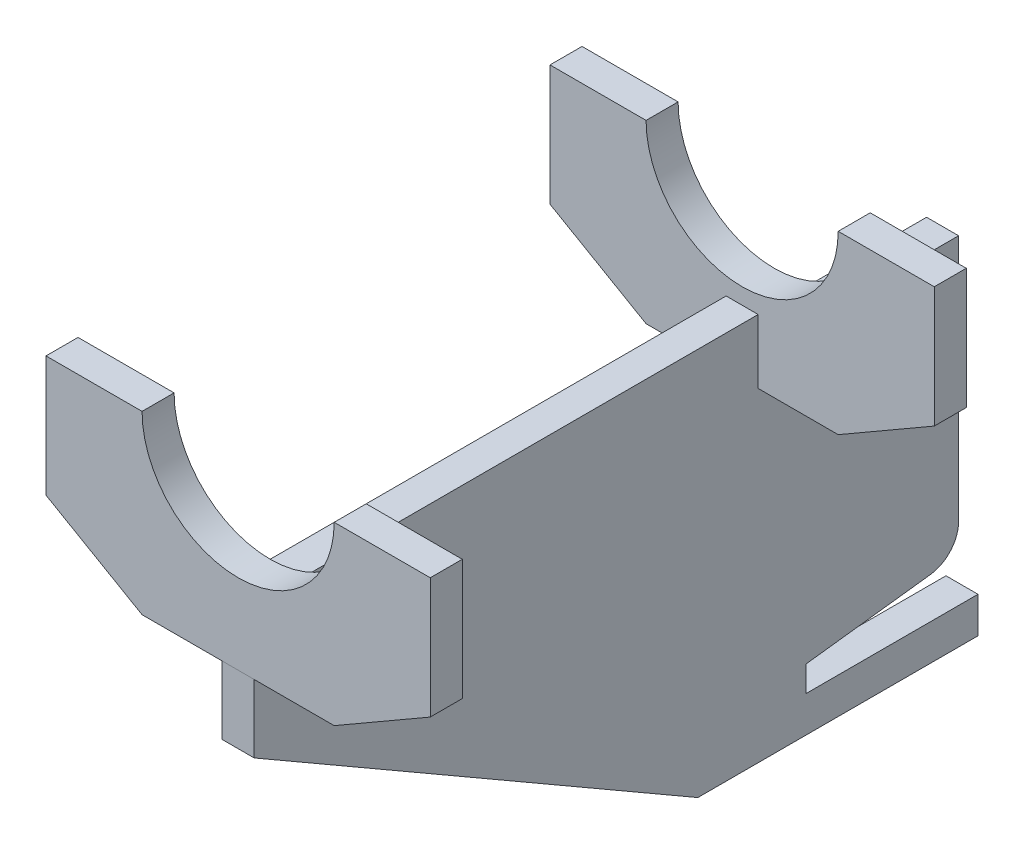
ISO-10303-21;
HEADER;
FILE_DESCRIPTION(('STEP AP214'),'2;1');
FILE_NAME('part.step','',(''),(''),'','','');
FILE_SCHEMA(('AUTOMOTIVE_DESIGN { 1 0 10303 214 1 1 1 1 }'));
ENDSEC;
DATA;
#1=APPLICATION_CONTEXT('core data for automotive mechanical design processes');
#2=APPLICATION_PROTOCOL_DEFINITION('international standard','automotive_design',2000,#1);
#3=PRODUCT_CONTEXT('',#1,'mechanical');
#4=PRODUCT('Part','Part','',(#3));
#5=PRODUCT_RELATED_PRODUCT_CATEGORY('part','',(#4));
#6=PRODUCT_DEFINITION_FORMATION('','',#4);
#7=PRODUCT_DEFINITION_CONTEXT('part definition',#1,'design');
#8=PRODUCT_DEFINITION('design','',#6,#7);
#9=PRODUCT_DEFINITION_SHAPE('','',#8);
#10=(LENGTH_UNIT() NAMED_UNIT(*) SI_UNIT(.MILLI.,.METRE.));
#11=(NAMED_UNIT(*) PLANE_ANGLE_UNIT() SI_UNIT($,.RADIAN.));
#12=(NAMED_UNIT(*) SI_UNIT($,.STERADIAN.) SOLID_ANGLE_UNIT());
#13=UNCERTAINTY_MEASURE_WITH_UNIT(LENGTH_MEASURE(1.E-05),#10,'distance_accuracy_value','');
#14=(GEOMETRIC_REPRESENTATION_CONTEXT(3) GLOBAL_UNCERTAINTY_ASSIGNED_CONTEXT((#13)) GLOBAL_UNIT_ASSIGNED_CONTEXT((#10,
#11,#12)) REPRESENTATION_CONTEXT('',''));
#15=CARTESIAN_POINT('',(0.,0.,0.));
#16=DIRECTION('',(0.,0.,1.));
#17=DIRECTION('',(1.,0.,0.));
#18=AXIS2_PLACEMENT_3D('',#15,#16,#17);
#19=CARTESIAN_POINT('',(6.34999999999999,-96.8248,-279.4));
#20=DIRECTION('',(0.,0.,-1.));
#21=DIRECTION('',(-1.,0.,0.));
#22=AXIS2_PLACEMENT_3D('',#19,#20,#21);
#23=PLANE('',#22);
#24=DIRECTION('',(0.,-1.,0.));
#25=VECTOR('',#24,1.);
#26=CARTESIAN_POINT('',(6.34999999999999,-44.45,-279.4));
#27=LINE('',#26,#25);
#28=CARTESIAN_POINT('',(6.34999999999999,-57.15,-279.4));
#29=VERTEX_POINT('',#28);
#30=CARTESIAN_POINT('',(6.34999999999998,-155.331416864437,-279.4));
#31=VERTEX_POINT('',#30);
#32=EDGE_CURVE('E702',#29,#31,#27,.T.);
#33=ORIENTED_EDGE('',*,*,#32,.T.);
#34=DIRECTION('',(1.,0.,0.));
#35=VECTOR('',#34,1.);
#36=CARTESIAN_POINT('',(-6.35000000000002,-155.331416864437,-279.4));
#37=LINE('',#36,#35);
#38=CARTESIAN_POINT('',(-6.35000000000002,-155.331416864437,-279.4));
#39=VERTEX_POINT('',#38);
#40=EDGE_CURVE('E398',#31,#39,#37,.F.);
#41=ORIENTED_EDGE('',*,*,#40,.T.);
#42=DIRECTION('',(0.,1.,0.));
#43=VECTOR('',#42,1.);
#44=CARTESIAN_POINT('',(-6.35000000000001,-44.45,-279.4));
#45=LINE('',#44,#43);
#46=CARTESIAN_POINT('',(-6.35000000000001,-57.15,-279.4));
#47=VERTEX_POINT('',#46);
#48=EDGE_CURVE('E704',#39,#47,#45,.T.);
#49=ORIENTED_EDGE('',*,*,#48,.T.);
#50=DIRECTION('',(-1.,0.,0.));
#51=VECTOR('',#50,1.);
#52=CARTESIAN_POINT('',(76.2,-57.15,-279.4));
#53=LINE('',#52,#51);
#54=EDGE_CURVE('E598',#29,#47,#53,.T.);
#55=ORIENTED_EDGE('',*,*,#54,.F.);
#56=EDGE_LOOP('',(#33,#41,#49,#55));
#57=FACE_BOUND('',#56,.T.);
#58=ADVANCED_FACE('F390',(#57),#23,.T.);
#59=CARTESIAN_POINT('',(6.34999999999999,-44.45,-279.4));
#60=DIRECTION('',(-1.,0.,0.));
#61=DIRECTION('',(0.,-1.,0.));
#62=AXIS2_PLACEMENT_3D('',#59,#60,#61);
#63=PLANE('',#62);
#64=DIRECTION('',(0.,0.121869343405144,-0.992546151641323));
#65=VECTOR('',#64,1.);
#66=CARTESIAN_POINT('',(6.34999999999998,-164.753722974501,-294.171439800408));
#67=LINE('',#66,#65);
#68=CARTESIAN_POINT('',(6.34999999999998,-173.99,-218.948));
#69=VERTEX_POINT('',#68);
#70=CARTESIAN_POINT('',(6.34999999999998,-167.936752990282,-268.247740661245));
#71=VERTEX_POINT('',#70);
#72=EDGE_CURVE('E578',#69,#71,#67,.T.);
#73=ORIENTED_EDGE('',*,*,#72,.T.);
#74=CARTESIAN_POINT('',(6.34999999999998,-155.331416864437,-266.7));
#75=DIRECTION('',(-1.,0.,0.));
#76=DIRECTION('',(0.,-1.,0.));
#77=AXIS2_PLACEMENT_3D('',#74,#75,#76);
#78=CIRCLE('',#77,12.7);
#79=EDGE_CURVE('E412',#71,#31,#78,.F.);
#80=ORIENTED_EDGE('',*,*,#79,.T.);
#81=ORIENTED_EDGE('',*,*,#32,.F.);
#82=DIRECTION('',(0.,0.,1.));
#83=VECTOR('',#82,1.);
#84=CARTESIAN_POINT('',(6.34999999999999,-57.15,-279.4));
#85=LINE('',#84,#83);
#86=CARTESIAN_POINT('',(6.34999999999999,-57.15,-212.598));
#87=VERTEX_POINT('',#86);
#88=EDGE_CURVE('E602',#29,#87,#85,.T.);
#89=ORIENTED_EDGE('',*,*,#88,.T.);
#90=DIRECTION('',(0.,1.,0.));
#91=VECTOR('',#90,1.);
#92=CARTESIAN_POINT('',(6.34999999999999,-44.45,-212.598));
#93=LINE('',#92,#91);
#94=CARTESIAN_POINT('',(6.34999999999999,-69.85,-212.598));
#95=VERTEX_POINT('',#94);
#96=EDGE_CURVE('E685',#95,#87,#93,.T.);
#97=ORIENTED_EDGE('',*,*,#96,.F.);
#98=DIRECTION('',(0.,0.,1.));
#99=VECTOR('',#98,1.);
#100=CARTESIAN_POINT('',(6.34999999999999,-69.85,-279.4));
#101=LINE('',#100,#99);
#102=CARTESIAN_POINT('',(6.34999999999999,-69.85,-199.898));
#103=VERTEX_POINT('',#102);
#104=EDGE_CURVE('E688',#95,#103,#101,.T.);
#105=ORIENTED_EDGE('',*,*,#104,.T.);
#106=DIRECTION('',(0.,1.,0.));
#107=VECTOR('',#106,1.);
#108=CARTESIAN_POINT('',(6.34999999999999,-44.45,-199.898));
#109=LINE('',#108,#107);
#110=CARTESIAN_POINT('',(6.34999999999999,-44.45,-199.898));
#111=VERTEX_POINT('',#110);
#112=EDGE_CURVE('E680',#103,#111,#109,.T.);
#113=ORIENTED_EDGE('',*,*,#112,.T.);
#114=DIRECTION('',(0.,0.,1.));
#115=VECTOR('',#114,1.);
#116=CARTESIAN_POINT('',(6.34999999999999,-44.45,-279.4));
#117=LINE('',#116,#115);
#118=CARTESIAN_POINT('',(6.34999999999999,-44.45,0.));
#119=VERTEX_POINT('',#118);
#120=EDGE_CURVE('E706',#111,#119,#117,.T.);
#121=ORIENTED_EDGE('',*,*,#120,.T.);
#122=DIRECTION('',(0.,-1.,0.));
#123=VECTOR('',#122,1.);
#124=CARTESIAN_POINT('',(6.34999999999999,-44.45,0.));
#125=LINE('',#124,#123);
#126=CARTESIAN_POINT('',(6.34999999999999,-96.8248,0.));
#127=VERTEX_POINT('',#126);
#128=EDGE_CURVE('E691',#119,#127,#125,.T.);
#129=ORIENTED_EDGE('',*,*,#128,.T.);
#130=DIRECTION('',(0.,0.499999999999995,0.866025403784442));
#131=VECTOR('',#130,1.);
#132=CARTESIAN_POINT('',(6.34999999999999,-96.8248,0.));
#133=LINE('',#132,#131);
#134=CARTESIAN_POINT('',(6.34999999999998,-198.4248,-175.976362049));
#135=VERTEX_POINT('',#134);
#136=EDGE_CURVE('E591',#135,#127,#133,.T.);
#137=ORIENTED_EDGE('',*,*,#136,.F.);
#138=DIRECTION('',(0.,0.,1.));
#139=VECTOR('',#138,1.);
#140=CARTESIAN_POINT('',(6.34999999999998,-198.4248,-279.4));
#141=LINE('',#140,#139);
#142=CARTESIAN_POINT('',(6.34999999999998,-198.4248,-287.0962));
#143=VERTEX_POINT('',#142);
#144=EDGE_CURVE('E588',#143,#135,#141,.T.);
#145=ORIENTED_EDGE('',*,*,#144,.F.);
#146=DIRECTION('',(0.,-1.,0.));
#147=VECTOR('',#146,1.);
#148=CARTESIAN_POINT('',(6.34999999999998,-184.15,-287.0962));
#149=LINE('',#148,#147);
#150=CARTESIAN_POINT('',(6.34999999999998,-184.15,-287.0962));
#151=VERTEX_POINT('',#150);
#152=EDGE_CURVE('E560',#151,#143,#149,.T.);
#153=ORIENTED_EDGE('',*,*,#152,.F.);
#154=DIRECTION('',(0.,0.,1.));
#155=VECTOR('',#154,1.);
#156=CARTESIAN_POINT('',(6.34999999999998,-184.15,-279.4));
#157=LINE('',#156,#155);
#158=CARTESIAN_POINT('',(6.34999999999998,-184.15,-218.948));
#159=VERTEX_POINT('',#158);
#160=EDGE_CURVE('E556',#151,#159,#157,.T.);
#161=ORIENTED_EDGE('',*,*,#160,.T.);
#162=DIRECTION('',(0.,1.,0.));
#163=VECTOR('',#162,1.);
#164=CARTESIAN_POINT('',(6.34999999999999,-44.4499999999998,-218.948));
#165=LINE('',#164,#163);
#166=EDGE_CURVE('E580',#159,#69,#165,.T.);
#167=ORIENTED_EDGE('',*,*,#166,.T.);
#168=EDGE_LOOP('',(#73,#80,#81,#89,#97,#105,#113,#121,#129,#137,#145,#153,#161,#167));
#169=FACE_BOUND('',#168,.T.);
#170=ADVANCED_FACE('F392',(#169),#63,.F.);
#171=CARTESIAN_POINT('',(-6.35000000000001,-44.45,-279.4));
#172=DIRECTION('',(1.,0.,0.));
#173=DIRECTION('',(0.,1.,0.));
#174=AXIS2_PLACEMENT_3D('',#171,#172,#173);
#175=PLANE('',#174);
#176=ORIENTED_EDGE('',*,*,#48,.F.);
#177=CARTESIAN_POINT('',(-6.35000000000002,-155.331416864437,-266.7));
#178=DIRECTION('',(1.,0.,0.));
#179=DIRECTION('',(0.,1.,0.));
#180=AXIS2_PLACEMENT_3D('',#177,#178,#179);
#181=CIRCLE('',#180,12.7);
#182=CARTESIAN_POINT('',(-6.35000000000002,-167.936752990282,-268.247740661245));
#183=VERTEX_POINT('',#182);
#184=EDGE_CURVE('E12',#39,#183,#181,.F.);
#185=ORIENTED_EDGE('',*,*,#184,.T.);
#186=DIRECTION('',(0.,0.121869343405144,-0.992546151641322));
#187=VECTOR('',#186,1.);
#188=CARTESIAN_POINT('',(-6.35000000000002,-166.567427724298,-279.4));
#189=LINE('',#188,#187);
#190=CARTESIAN_POINT('',(-6.35000000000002,-173.99,-218.948));
#191=VERTEX_POINT('',#190);
#192=EDGE_CURVE('E570',#191,#183,#189,.T.);
#193=ORIENTED_EDGE('',*,*,#192,.F.);
#194=DIRECTION('',(0.,1.,0.));
#195=VECTOR('',#194,1.);
#196=CARTESIAN_POINT('',(-6.35000000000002,-173.99,-218.948));
#197=LINE('',#196,#195);
#198=CARTESIAN_POINT('',(-6.35000000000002,-184.15,-218.948));
#199=VERTEX_POINT('',#198);
#200=EDGE_CURVE('E547',#199,#191,#197,.T.);
#201=ORIENTED_EDGE('',*,*,#200,.F.);
#202=DIRECTION('',(0.,0.,1.));
#203=VECTOR('',#202,1.);
#204=CARTESIAN_POINT('',(-6.35000000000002,-184.15,-218.948));
#205=LINE('',#204,#203);
#206=CARTESIAN_POINT('',(-6.35000000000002,-184.15,-287.0962));
#207=VERTEX_POINT('',#206);
#208=EDGE_CURVE('E539',#207,#199,#205,.T.);
#209=ORIENTED_EDGE('',*,*,#208,.F.);
#210=DIRECTION('',(0.,1.,0.));
#211=VECTOR('',#210,1.);
#212=CARTESIAN_POINT('',(-6.35000000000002,-198.4248,-287.0962));
#213=LINE('',#212,#211);
#214=CARTESIAN_POINT('',(-6.35000000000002,-198.4248,-287.0962));
#215=VERTEX_POINT('',#214);
#216=EDGE_CURVE('E544',#215,#207,#213,.T.);
#217=ORIENTED_EDGE('',*,*,#216,.F.);
#218=DIRECTION('',(0.,0.,1.));
#219=VECTOR('',#218,1.);
#220=CARTESIAN_POINT('',(-6.35000000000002,-198.4248,-279.4));
#221=LINE('',#220,#219);
#222=CARTESIAN_POINT('',(-6.35000000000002,-198.4248,-175.976362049));
#223=VERTEX_POINT('',#222);
#224=EDGE_CURVE('E583',#215,#223,#221,.T.);
#225=ORIENTED_EDGE('',*,*,#224,.T.);
#226=DIRECTION('',(0.,0.499999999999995,0.866025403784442));
#227=VECTOR('',#226,1.);
#228=CARTESIAN_POINT('',(-6.35000000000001,-96.8248,0.));
#229=LINE('',#228,#227);
#230=CARTESIAN_POINT('',(-6.35000000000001,-96.8248,0.));
#231=VERTEX_POINT('',#230);
#232=EDGE_CURVE('E585',#223,#231,#229,.T.);
#233=ORIENTED_EDGE('',*,*,#232,.T.);
#234=DIRECTION('',(0.,1.,0.));
#235=VECTOR('',#234,1.);
#236=CARTESIAN_POINT('',(-6.35000000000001,-44.45,0.));
#237=LINE('',#236,#235);
#238=CARTESIAN_POINT('',(-6.35000000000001,-44.45,0.));
#239=VERTEX_POINT('',#238);
#240=EDGE_CURVE('E696',#231,#239,#237,.T.);
#241=ORIENTED_EDGE('',*,*,#240,.T.);
#242=DIRECTION('',(0.,0.,1.));
#243=VECTOR('',#242,1.);
#244=CARTESIAN_POINT('',(-6.35000000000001,-44.45,-279.4));
#245=LINE('',#244,#243);
#246=CARTESIAN_POINT('',(-6.35000000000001,-44.45,-199.898));
#247=VERTEX_POINT('',#246);
#248=EDGE_CURVE('E708',#247,#239,#245,.T.);
#249=ORIENTED_EDGE('',*,*,#248,.F.);
#250=DIRECTION('',(0.,-1.,0.));
#251=VECTOR('',#250,1.);
#252=CARTESIAN_POINT('',(-6.35000000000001,-44.45,-199.898));
#253=LINE('',#252,#251);
#254=CARTESIAN_POINT('',(-6.35000000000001,-69.85,-199.898));
#255=VERTEX_POINT('',#254);
#256=EDGE_CURVE('E677',#247,#255,#253,.T.);
#257=ORIENTED_EDGE('',*,*,#256,.T.);
#258=DIRECTION('',(0.,0.,-1.));
#259=VECTOR('',#258,1.);
#260=CARTESIAN_POINT('',(-6.35000000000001,-69.85,-279.4));
#261=LINE('',#260,#259);
#262=CARTESIAN_POINT('',(-6.35000000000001,-69.85,-212.598));
#263=VERTEX_POINT('',#262);
#264=EDGE_CURVE('E713',#255,#263,#261,.T.);
#265=ORIENTED_EDGE('',*,*,#264,.T.);
#266=DIRECTION('',(0.,-1.,0.));
#267=VECTOR('',#266,1.);
#268=CARTESIAN_POINT('',(-6.35000000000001,-44.45,-212.598));
#269=LINE('',#268,#267);
#270=CARTESIAN_POINT('',(-6.35000000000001,-57.15,-212.598));
#271=VERTEX_POINT('',#270);
#272=EDGE_CURVE('E683',#271,#263,#269,.T.);
#273=ORIENTED_EDGE('',*,*,#272,.F.);
#274=DIRECTION('',(0.,0.,1.));
#275=VECTOR('',#274,1.);
#276=CARTESIAN_POINT('',(-6.35000000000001,-57.15,-212.598));
#277=LINE('',#276,#275);
#278=EDGE_CURVE('E596',#47,#271,#277,.T.);
#279=ORIENTED_EDGE('',*,*,#278,.F.);
#280=EDGE_LOOP('',(#176,#185,#193,#201,#209,#217,#225,#233,#241,#249,#257,#265,#273,#279));
#281=FACE_BOUND('',#280,.T.);
#282=ADVANCED_FACE('F541',(#281),#175,.F.);
#283=CARTESIAN_POINT('',(6.34999999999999,-44.45,-279.4));
#284=DIRECTION('',(0.,-1.,0.));
#285=DIRECTION('',(0.,0.,-1.));
#286=AXIS2_PLACEMENT_3D('',#283,#284,#285);
#287=PLANE('',#286);
#288=ORIENTED_EDGE('',*,*,#120,.F.);
#289=DIRECTION('',(-1.,0.,0.));
#290=VECTOR('',#289,1.);
#291=CARTESIAN_POINT('',(6.34999999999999,-44.45,-199.898));
#292=LINE('',#291,#290);
#293=EDGE_CURVE('E710',#111,#247,#292,.T.);
#294=ORIENTED_EDGE('',*,*,#293,.T.);
#295=ORIENTED_EDGE('',*,*,#248,.T.);
#296=DIRECTION('',(1.,0.,0.));
#297=VECTOR('',#296,1.);
#298=CARTESIAN_POINT('',(6.34999999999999,-44.45,0.));
#299=LINE('',#298,#297);
#300=EDGE_CURVE('E699',#239,#119,#299,.T.);
#301=ORIENTED_EDGE('',*,*,#300,.T.);
#302=EDGE_LOOP('',(#288,#294,#295,#301));
#303=FACE_BOUND('',#302,.T.);
#304=ADVANCED_FACE('F745',(#303),#287,.F.);
#305=CARTESIAN_POINT('',(6.34999999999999,-96.8248,0.));
#306=DIRECTION('',(0.,0.,-1.));
#307=DIRECTION('',(-1.,0.,0.));
#308=AXIS2_PLACEMENT_3D('',#305,#306,#307);
#309=PLANE('',#308);
#310=ORIENTED_EDGE('',*,*,#128,.F.);
#311=ORIENTED_EDGE('',*,*,#300,.F.);
#312=ORIENTED_EDGE('',*,*,#240,.F.);
#313=DIRECTION('',(-1.,0.,0.));
#314=VECTOR('',#313,1.);
#315=CARTESIAN_POINT('',(6.34999999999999,-96.8248,0.));
#316=LINE('',#315,#314);
#317=EDGE_CURVE('E693',#127,#231,#316,.T.);
#318=ORIENTED_EDGE('',*,*,#317,.F.);
#319=EDGE_LOOP('',(#310,#311,#312,#318));
#320=FACE_BOUND('',#319,.T.);
#321=ADVANCED_FACE('F743',(#320),#309,.F.);
#322=CARTESIAN_POINT('',(-38.1,-69.85,-212.598));
#323=DIRECTION('',(0.,-1.,0.));
#324=DIRECTION('',(0.,0.,-1.));
#325=AXIS2_PLACEMENT_3D('',#322,#323,#324);
#326=PLANE('',#325);
#327=ORIENTED_EDGE('',*,*,#104,.F.);
#328=DIRECTION('',(1.,0.,0.));
#329=VECTOR('',#328,1.);
#330=CARTESIAN_POINT('',(-38.1,-69.85,-212.598));
#331=LINE('',#330,#329);
#332=CARTESIAN_POINT('',(38.1,-69.85,-212.598));
#333=VERTEX_POINT('',#332);
#334=EDGE_CURVE('E673',#95,#333,#331,.T.);
#335=ORIENTED_EDGE('',*,*,#334,.T.);
#336=DIRECTION('',(0.,0.,1.));
#337=VECTOR('',#336,1.);
#338=CARTESIAN_POINT('',(38.1,-69.85,-212.598));
#339=LINE('',#338,#337);
#340=CARTESIAN_POINT('',(38.1,-69.85,-199.898));
#341=VERTEX_POINT('',#340);
#342=EDGE_CURVE('E664',#333,#341,#339,.T.);
#343=ORIENTED_EDGE('',*,*,#342,.T.);
#344=DIRECTION('',(1.,0.,0.));
#345=VECTOR('',#344,1.);
#346=CARTESIAN_POINT('',(-38.1,-69.85,-199.898));
#347=LINE('',#346,#345);
#348=EDGE_CURVE('E669',#103,#341,#347,.T.);
#349=ORIENTED_EDGE('',*,*,#348,.F.);
#350=EDGE_LOOP('',(#327,#335,#343,#349));
#351=FACE_BOUND('',#350,.T.);
#352=ADVANCED_FACE('F860',(#351),#326,.T.);
#353=ORIENTED_EDGE('',*,*,#264,.F.);
#354=CARTESIAN_POINT('',(-38.1,-69.85,-199.898));
#355=VERTEX_POINT('',#354);
#356=EDGE_CURVE('E670',#355,#255,#347,.T.);
#357=ORIENTED_EDGE('',*,*,#356,.F.);
#358=DIRECTION('',(0.,0.,1.));
#359=VECTOR('',#358,1.);
#360=CARTESIAN_POINT('',(-38.1,-69.85,-212.598));
#361=LINE('',#360,#359);
#362=CARTESIAN_POINT('',(-38.1,-69.85,-212.598));
#363=VERTEX_POINT('',#362);
#364=EDGE_CURVE('E614',#363,#355,#361,.T.);
#365=ORIENTED_EDGE('',*,*,#364,.F.);
#366=EDGE_CURVE('E674',#363,#263,#331,.T.);
#367=ORIENTED_EDGE('',*,*,#366,.T.);
#368=EDGE_LOOP('',(#353,#357,#365,#367));
#369=FACE_BOUND('',#368,.T.);
#370=ADVANCED_FACE('F863',(#369),#326,.T.);
#371=CARTESIAN_POINT('',(0.,0.,-212.598));
#372=DIRECTION('',(0.,0.,1.));
#373=DIRECTION('',(1.,0.,0.));
#374=AXIS2_PLACEMENT_3D('',#371,#372,#373);
#375=PLANE('',#374);
#376=DIRECTION('',(-1.,0.,0.));
#377=VECTOR('',#376,1.);
#378=CARTESIAN_POINT('',(38.1,0.,-212.598));
#379=LINE('',#378,#377);
#380=CARTESIAN_POINT('',(76.2,0.,-212.598));
#381=VERTEX_POINT('',#380);
#382=CARTESIAN_POINT('',(38.1,0.,-212.598));
#383=VERTEX_POINT('',#382);
#384=EDGE_CURVE('E650',#381,#383,#379,.T.);
#385=ORIENTED_EDGE('',*,*,#384,.F.);
#386=DIRECTION('',(0.,1.,0.));
#387=VECTOR('',#386,1.);
#388=CARTESIAN_POINT('',(76.2,-47.8529547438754,-212.598));
#389=LINE('',#388,#387);
#390=CARTESIAN_POINT('',(76.2,-47.8529547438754,-212.598));
#391=VERTEX_POINT('',#390);
#392=EDGE_CURVE('E659',#391,#381,#389,.T.);
#393=ORIENTED_EDGE('',*,*,#392,.F.);
#394=DIRECTION('',(0.86602540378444,0.499999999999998,0.));
#395=VECTOR('',#394,1.);
#396=CARTESIAN_POINT('',(38.1,-69.85,-212.598));
#397=LINE('',#396,#395);
#398=EDGE_CURVE('E667',#333,#391,#397,.T.);
#399=ORIENTED_EDGE('',*,*,#398,.F.);
#400=ORIENTED_EDGE('',*,*,#334,.F.);
#401=ORIENTED_EDGE('',*,*,#96,.T.);
#402=DIRECTION('',(-1.,0.,0.));
#403=VECTOR('',#402,1.);
#404=CARTESIAN_POINT('',(76.2,-57.15,-212.598));
#405=LINE('',#404,#403);
#406=EDGE_CURVE('E599',#87,#271,#405,.T.);
#407=ORIENTED_EDGE('',*,*,#406,.T.);
#408=ORIENTED_EDGE('',*,*,#272,.T.);
#409=ORIENTED_EDGE('',*,*,#366,.F.);
#410=DIRECTION('',(0.86602540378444,-0.499999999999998,0.));
#411=VECTOR('',#410,1.);
#412=CARTESIAN_POINT('',(-76.2,-47.8529547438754,-212.598));
#413=LINE('',#412,#411);
#414=CARTESIAN_POINT('',(-76.2,-47.8529547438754,-212.598));
#415=VERTEX_POINT('',#414);
#416=EDGE_CURVE('E612',#415,#363,#413,.T.);
#417=ORIENTED_EDGE('',*,*,#416,.F.);
#418=DIRECTION('',(0.,-1.,0.));
#419=VECTOR('',#418,1.);
#420=CARTESIAN_POINT('',(-76.2,0.,-212.598));
#421=LINE('',#420,#419);
#422=CARTESIAN_POINT('',(-76.2,0.,-212.598));
#423=VERTEX_POINT('',#422);
#424=EDGE_CURVE('E623',#423,#415,#421,.T.);
#425=ORIENTED_EDGE('',*,*,#424,.F.);
#426=DIRECTION('',(-1.,0.,0.));
#427=VECTOR('',#426,1.);
#428=CARTESIAN_POINT('',(-76.2,0.,-212.598));
#429=LINE('',#428,#427);
#430=CARTESIAN_POINT('',(-38.1,0.,-212.598));
#431=VERTEX_POINT('',#430);
#432=EDGE_CURVE('E632',#431,#423,#429,.T.);
#433=ORIENTED_EDGE('',*,*,#432,.F.);
#434=CARTESIAN_POINT('',(0.,0.,-212.598));
#435=DIRECTION('',(0.,0.,-1.));
#436=DIRECTION('',(1.,0.,0.));
#437=AXIS2_PLACEMENT_3D('',#434,#435,#436);
#438=CIRCLE('',#437,38.1);
#439=EDGE_CURVE('E641',#383,#431,#438,.T.);
#440=ORIENTED_EDGE('',*,*,#439,.F.);
#441=EDGE_LOOP('',(#385,#393,#399,#400,#401,#407,#408,#409,#417,#425,#433,#440));
#442=FACE_BOUND('',#441,.T.);
#443=ADVANCED_FACE('F865',(#442),#375,.F.);
#444=CARTESIAN_POINT('',(0.,0.,-199.898));
#445=DIRECTION('',(0.,0.,1.));
#446=DIRECTION('',(1.,0.,0.));
#447=AXIS2_PLACEMENT_3D('',#444,#445,#446);
#448=PLANE('',#447);
#449=ORIENTED_EDGE('',*,*,#112,.F.);
#450=ORIENTED_EDGE('',*,*,#348,.T.);
#451=DIRECTION('',(0.86602540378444,0.499999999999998,0.));
#452=VECTOR('',#451,1.);
#453=CARTESIAN_POINT('',(38.1,-69.85,-199.898));
#454=LINE('',#453,#452);
#455=CARTESIAN_POINT('',(76.2,-47.8529547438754,-199.898));
#456=VERTEX_POINT('',#455);
#457=EDGE_CURVE('E661',#341,#456,#454,.T.);
#458=ORIENTED_EDGE('',*,*,#457,.T.);
#459=DIRECTION('',(0.,1.,0.));
#460=VECTOR('',#459,1.);
#461=CARTESIAN_POINT('',(76.2,-47.8529547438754,-199.898));
#462=LINE('',#461,#460);
#463=CARTESIAN_POINT('',(76.2,0.,-199.898));
#464=VERTEX_POINT('',#463);
#465=EDGE_CURVE('E653',#456,#464,#462,.T.);
#466=ORIENTED_EDGE('',*,*,#465,.T.);
#467=DIRECTION('',(-1.,0.,0.));
#468=VECTOR('',#467,1.);
#469=CARTESIAN_POINT('',(38.1,0.,-199.898));
#470=LINE('',#469,#468);
#471=CARTESIAN_POINT('',(38.1,0.,-199.898));
#472=VERTEX_POINT('',#471);
#473=EDGE_CURVE('E644',#464,#472,#470,.T.);
#474=ORIENTED_EDGE('',*,*,#473,.T.);
#475=CARTESIAN_POINT('',(0.,0.,-199.898));
#476=DIRECTION('',(0.,0.,-1.));
#477=DIRECTION('',(1.,0.,0.));
#478=AXIS2_PLACEMENT_3D('',#475,#476,#477);
#479=CIRCLE('',#478,38.1);
#480=CARTESIAN_POINT('',(-38.1,0.,-199.898));
#481=VERTEX_POINT('',#480);
#482=EDGE_CURVE('E635',#472,#481,#479,.T.);
#483=ORIENTED_EDGE('',*,*,#482,.T.);
#484=DIRECTION('',(-1.,0.,0.));
#485=VECTOR('',#484,1.);
#486=CARTESIAN_POINT('',(-76.2,0.,-199.898));
#487=LINE('',#486,#485);
#488=CARTESIAN_POINT('',(-76.2,0.,-199.898));
#489=VERTEX_POINT('',#488);
#490=EDGE_CURVE('E626',#481,#489,#487,.T.);
#491=ORIENTED_EDGE('',*,*,#490,.T.);
#492=DIRECTION('',(0.,-1.,0.));
#493=VECTOR('',#492,1.);
#494=CARTESIAN_POINT('',(-76.2,0.,-199.898));
#495=LINE('',#494,#493);
#496=CARTESIAN_POINT('',(-76.2,-47.8529547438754,-199.898));
#497=VERTEX_POINT('',#496);
#498=EDGE_CURVE('E617',#489,#497,#495,.T.);
#499=ORIENTED_EDGE('',*,*,#498,.T.);
#500=DIRECTION('',(0.86602540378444,-0.499999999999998,0.));
#501=VECTOR('',#500,1.);
#502=CARTESIAN_POINT('',(-76.2,-47.8529547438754,-199.898));
#503=LINE('',#502,#501);
#504=EDGE_CURVE('E607',#497,#355,#503,.T.);
#505=ORIENTED_EDGE('',*,*,#504,.T.);
#506=ORIENTED_EDGE('',*,*,#356,.T.);
#507=ORIENTED_EDGE('',*,*,#256,.F.);
#508=ORIENTED_EDGE('',*,*,#293,.F.);
#509=EDGE_LOOP('',(#449,#450,#458,#466,#474,#483,#491,#499,#505,#506,#507,#508));
#510=FACE_BOUND('',#509,.T.);
#511=ADVANCED_FACE('F836',(#510),#448,.T.);
#512=CARTESIAN_POINT('',(-76.2,-47.8529547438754,-212.598));
#513=DIRECTION('',(-0.499999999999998,-0.86602540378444,0.));
#514=DIRECTION('',(0.86602540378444,-0.499999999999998,0.));
#515=AXIS2_PLACEMENT_3D('',#512,#513,#514);
#516=PLANE('',#515);
#517=ORIENTED_EDGE('',*,*,#504,.F.);
#518=DIRECTION('',(0.,0.,1.));
#519=VECTOR('',#518,1.);
#520=CARTESIAN_POINT('',(-76.2,-47.8529547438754,-212.598));
#521=LINE('',#520,#519);
#522=EDGE_CURVE('E609',#415,#497,#521,.T.);
#523=ORIENTED_EDGE('',*,*,#522,.F.);
#524=ORIENTED_EDGE('',*,*,#416,.T.);
#525=ORIENTED_EDGE('',*,*,#364,.T.);
#526=EDGE_LOOP('',(#517,#523,#524,#525));
#527=FACE_BOUND('',#526,.T.);
#528=ADVANCED_FACE('F832',(#527),#516,.T.);
#529=CARTESIAN_POINT('',(-76.2,0.,-212.598));
#530=DIRECTION('',(-1.,0.,0.));
#531=DIRECTION('',(0.,0.,1.));
#532=AXIS2_PLACEMENT_3D('',#529,#530,#531);
#533=PLANE('',#532);
#534=ORIENTED_EDGE('',*,*,#498,.F.);
#535=DIRECTION('',(0.,0.,1.));
#536=VECTOR('',#535,1.);
#537=CARTESIAN_POINT('',(-76.2,0.,-212.598));
#538=LINE('',#537,#536);
#539=EDGE_CURVE('E620',#423,#489,#538,.T.);
#540=ORIENTED_EDGE('',*,*,#539,.F.);
#541=ORIENTED_EDGE('',*,*,#424,.T.);
#542=ORIENTED_EDGE('',*,*,#522,.T.);
#543=EDGE_LOOP('',(#534,#540,#541,#542));
#544=FACE_BOUND('',#543,.T.);
#545=ADVANCED_FACE('F835',(#544),#533,.T.);
#546=CARTESIAN_POINT('',(-76.2,0.,-212.598));
#547=DIRECTION('',(0.,1.,0.));
#548=DIRECTION('',(-1.,0.,0.));
#549=AXIS2_PLACEMENT_3D('',#546,#547,#548);
#550=PLANE('',#549);
#551=ORIENTED_EDGE('',*,*,#490,.F.);
#552=DIRECTION('',(0.,0.,1.));
#553=VECTOR('',#552,1.);
#554=CARTESIAN_POINT('',(-38.1,0.,-212.598));
#555=LINE('',#554,#553);
#556=EDGE_CURVE('E629',#431,#481,#555,.T.);
#557=ORIENTED_EDGE('',*,*,#556,.F.);
#558=ORIENTED_EDGE('',*,*,#432,.T.);
#559=ORIENTED_EDGE('',*,*,#539,.T.);
#560=EDGE_LOOP('',(#551,#557,#558,#559));
#561=FACE_BOUND('',#560,.T.);
#562=ADVANCED_FACE('F840',(#561),#550,.T.);
#563=CARTESIAN_POINT('',(0.,0.,-212.598));
#564=DIRECTION('',(0.,0.,1.));
#565=DIRECTION('',(1.,0.,0.));
#566=AXIS2_PLACEMENT_3D('',#563,#564,#565);
#567=CYLINDRICAL_SURFACE('',#566,38.1);
#568=ORIENTED_EDGE('',*,*,#482,.F.);
#569=DIRECTION('',(0.,0.,1.));
#570=VECTOR('',#569,1.);
#571=CARTESIAN_POINT('',(38.1,0.,-212.598));
#572=LINE('',#571,#570);
#573=EDGE_CURVE('E638',#383,#472,#572,.T.);
#574=ORIENTED_EDGE('',*,*,#573,.F.);
#575=ORIENTED_EDGE('',*,*,#439,.T.);
#576=ORIENTED_EDGE('',*,*,#556,.T.);
#577=EDGE_LOOP('',(#568,#574,#575,#576));
#578=FACE_BOUND('',#577,.T.);
#579=ADVANCED_FACE('F844',(#578),#567,.F.);
#580=CARTESIAN_POINT('',(38.1,0.,-212.598));
#581=DIRECTION('',(0.,1.,0.));
#582=DIRECTION('',(0.,0.,1.));
#583=AXIS2_PLACEMENT_3D('',#580,#581,#582);
#584=PLANE('',#583);
#585=ORIENTED_EDGE('',*,*,#473,.F.);
#586=DIRECTION('',(0.,0.,1.));
#587=VECTOR('',#586,1.);
#588=CARTESIAN_POINT('',(76.2,0.,-212.598));
#589=LINE('',#588,#587);
#590=EDGE_CURVE('E647',#381,#464,#589,.T.);
#591=ORIENTED_EDGE('',*,*,#590,.F.);
#592=ORIENTED_EDGE('',*,*,#384,.T.);
#593=ORIENTED_EDGE('',*,*,#573,.T.);
#594=EDGE_LOOP('',(#585,#591,#592,#593));
#595=FACE_BOUND('',#594,.T.);
#596=ADVANCED_FACE('F848',(#595),#584,.T.);
#597=CARTESIAN_POINT('',(76.2,-47.8529547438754,-212.598));
#598=DIRECTION('',(1.,0.,0.));
#599=DIRECTION('',(0.,0.,-1.));
#600=AXIS2_PLACEMENT_3D('',#597,#598,#599);
#601=PLANE('',#600);
#602=ORIENTED_EDGE('',*,*,#465,.F.);
#603=DIRECTION('',(0.,0.,1.));
#604=VECTOR('',#603,1.);
#605=CARTESIAN_POINT('',(76.2,-47.8529547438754,-212.598));
#606=LINE('',#605,#604);
#607=EDGE_CURVE('E656',#391,#456,#606,.T.);
#608=ORIENTED_EDGE('',*,*,#607,.F.);
#609=ORIENTED_EDGE('',*,*,#392,.T.);
#610=ORIENTED_EDGE('',*,*,#590,.T.);
#611=EDGE_LOOP('',(#602,#608,#609,#610));
#612=FACE_BOUND('',#611,.T.);
#613=ADVANCED_FACE('F852',(#612),#601,.T.);
#614=CARTESIAN_POINT('',(38.1,-69.85,-212.598));
#615=DIRECTION('',(0.499999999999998,-0.86602540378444,0.));
#616=DIRECTION('',(0.86602540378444,0.499999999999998,0.));
#617=AXIS2_PLACEMENT_3D('',#614,#615,#616);
#618=PLANE('',#617);
#619=ORIENTED_EDGE('',*,*,#457,.F.);
#620=ORIENTED_EDGE('',*,*,#342,.F.);
#621=ORIENTED_EDGE('',*,*,#398,.T.);
#622=ORIENTED_EDGE('',*,*,#607,.T.);
#623=EDGE_LOOP('',(#619,#620,#621,#622));
#624=FACE_BOUND('',#623,.T.);
#625=ADVANCED_FACE('F830',(#624),#618,.T.);
#626=CARTESIAN_POINT('',(76.2,-57.15,-212.598));
#627=DIRECTION('',(0.,-1.,0.));
#628=DIRECTION('',(0.,0.,-1.));
#629=AXIS2_PLACEMENT_3D('',#626,#627,#628);
#630=PLANE('',#629);
#631=ORIENTED_EDGE('',*,*,#54,.T.);
#632=ORIENTED_EDGE('',*,*,#278,.T.);
#633=ORIENTED_EDGE('',*,*,#406,.F.);
#634=ORIENTED_EDGE('',*,*,#88,.F.);
#635=EDGE_LOOP('',(#631,#632,#633,#634));
#636=FACE_BOUND('',#635,.T.);
#637=ADVANCED_FACE('F786',(#636),#630,.F.);
#638=CARTESIAN_POINT('',(6.34999999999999,-96.8248,0.));
#639=DIRECTION('',(0.,-0.866025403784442,0.499999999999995));
#640=DIRECTION('',(0.,-0.499999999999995,-0.866025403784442));
#641=AXIS2_PLACEMENT_3D('',#638,#639,#640);
#642=PLANE('',#641);
#643=ORIENTED_EDGE('',*,*,#232,.F.);
#644=DIRECTION('',(-1.,0.,0.));
#645=VECTOR('',#644,1.);
#646=CARTESIAN_POINT('',(6.34999999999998,-198.4248,-175.976362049));
#647=LINE('',#646,#645);
#648=EDGE_CURVE('E594',#135,#223,#647,.T.);
#649=ORIENTED_EDGE('',*,*,#648,.F.);
#650=ORIENTED_EDGE('',*,*,#136,.T.);
#651=ORIENTED_EDGE('',*,*,#317,.T.);
#652=EDGE_LOOP('',(#643,#649,#650,#651));
#653=FACE_BOUND('',#652,.T.);
#654=ADVANCED_FACE('F797',(#653),#642,.T.);
#655=CARTESIAN_POINT('',(6.34999999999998,-198.4248,-279.4));
#656=DIRECTION('',(0.,-1.,0.));
#657=DIRECTION('',(1.,0.,0.));
#658=AXIS2_PLACEMENT_3D('',#655,#656,#657);
#659=PLANE('',#658);
#660=ORIENTED_EDGE('',*,*,#224,.F.);
#661=DIRECTION('',(-1.,0.,0.));
#662=VECTOR('',#661,1.);
#663=CARTESIAN_POINT('',(6.34999999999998,-198.4248,-287.0962));
#664=LINE('',#663,#662);
#665=EDGE_CURVE('E550',#143,#215,#664,.T.);
#666=ORIENTED_EDGE('',*,*,#665,.F.);
#667=ORIENTED_EDGE('',*,*,#144,.T.);
#668=ORIENTED_EDGE('',*,*,#648,.T.);
#669=EDGE_LOOP('',(#660,#666,#667,#668));
#670=FACE_BOUND('',#669,.T.);
#671=ADVANCED_FACE('F802',(#670),#659,.T.);
#672=CARTESIAN_POINT('',(76.2,-173.99,-218.948));
#673=DIRECTION('',(0.,0.,1.));
#674=DIRECTION('',(0.,-1.,0.));
#675=AXIS2_PLACEMENT_3D('',#672,#673,#674);
#676=PLANE('',#675);
#677=DIRECTION('',(-1.,0.,0.));
#678=VECTOR('',#677,1.);
#679=CARTESIAN_POINT('',(76.2,-184.15,-218.948));
#680=LINE('',#679,#678);
#681=EDGE_CURVE('E573',#159,#199,#680,.T.);
#682=ORIENTED_EDGE('',*,*,#681,.T.);
#683=ORIENTED_EDGE('',*,*,#200,.T.);
#684=DIRECTION('',(-1.,0.,0.));
#685=VECTOR('',#684,1.);
#686=CARTESIAN_POINT('',(76.2,-173.99,-218.948));
#687=LINE('',#686,#685);
#688=EDGE_CURVE('E574',#69,#191,#687,.T.);
#689=ORIENTED_EDGE('',*,*,#688,.F.);
#690=ORIENTED_EDGE('',*,*,#166,.F.);
#691=EDGE_LOOP('',(#682,#683,#689,#690));
#692=FACE_BOUND('',#691,.T.);
#693=ADVANCED_FACE('F726',(#692),#676,.F.);
#694=CARTESIAN_POINT('',(76.2,-166.567427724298,-279.4));
#695=DIRECTION('',(0.,0.992546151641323,0.121869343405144));
#696=DIRECTION('',(0.,-0.121869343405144,0.992546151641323));
#697=AXIS2_PLACEMENT_3D('',#694,#695,#696);
#698=PLANE('',#697);
#699=ORIENTED_EDGE('',*,*,#192,.T.);
#700=DIRECTION('',(1.,0.,0.));
#701=VECTOR('',#700,1.);
#702=CARTESIAN_POINT('',(6.34999999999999,-167.936752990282,-268.247740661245));
#703=LINE('',#702,#701);
#704=EDGE_CURVE('E716',#183,#71,#703,.T.);
#705=ORIENTED_EDGE('',*,*,#704,.T.);
#706=ORIENTED_EDGE('',*,*,#72,.F.);
#707=ORIENTED_EDGE('',*,*,#688,.T.);
#708=EDGE_LOOP('',(#699,#705,#706,#707));
#709=FACE_BOUND('',#708,.T.);
#710=ADVANCED_FACE('F721',(#709),#698,.F.);
#711=CARTESIAN_POINT('',(76.2,-184.15,-218.948));
#712=DIRECTION('',(0.,-1.,0.));
#713=DIRECTION('',(1.,0.,0.));
#714=AXIS2_PLACEMENT_3D('',#711,#712,#713);
#715=PLANE('',#714);
#716=ORIENTED_EDGE('',*,*,#160,.F.);
#717=DIRECTION('',(1.,0.,0.));
#718=VECTOR('',#717,1.);
#719=CARTESIAN_POINT('',(-6.35000000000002,-184.15,-287.0962));
#720=LINE('',#719,#718);
#721=EDGE_CURVE('E553',#207,#151,#720,.T.);
#722=ORIENTED_EDGE('',*,*,#721,.F.);
#723=ORIENTED_EDGE('',*,*,#208,.T.);
#724=ORIENTED_EDGE('',*,*,#681,.F.);
#725=EDGE_LOOP('',(#716,#722,#723,#724));
#726=FACE_BOUND('',#725,.T.);
#727=ADVANCED_FACE('F554',(#726),#715,.F.);
#728=CARTESIAN_POINT('',(-6.35000000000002,-184.15,-287.0962));
#729=DIRECTION('',(0.,0.,-1.));
#730=DIRECTION('',(-1.,0.,0.));
#731=AXIS2_PLACEMENT_3D('',#728,#729,#730);
#732=PLANE('',#731);
#733=ORIENTED_EDGE('',*,*,#216,.T.);
#734=ORIENTED_EDGE('',*,*,#721,.T.);
#735=ORIENTED_EDGE('',*,*,#152,.T.);
#736=ORIENTED_EDGE('',*,*,#665,.T.);
#737=EDGE_LOOP('',(#733,#734,#735,#736));
#738=FACE_BOUND('',#737,.T.);
#739=ADVANCED_FACE('F563',(#738),#732,.T.);
#740=CARTESIAN_POINT('',(76.2,-155.331416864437,-266.7));
#741=DIRECTION('',(-1.,0.,0.));
#742=DIRECTION('',(0.,-1.,0.));
#743=AXIS2_PLACEMENT_3D('',#740,#741,#742);
#744=CYLINDRICAL_SURFACE('',#743,12.7);
#745=ORIENTED_EDGE('',*,*,#184,.F.);
#746=ORIENTED_EDGE('',*,*,#40,.F.);
#747=ORIENTED_EDGE('',*,*,#79,.F.);
#748=ORIENTED_EDGE('',*,*,#704,.F.);
#749=EDGE_LOOP('',(#745,#746,#747,#748));
#750=FACE_BOUND('',#749,.T.);
#751=ADVANCED_FACE('F728',(#750),#744,.T.);
#752=CLOSED_SHELL('',(#58,#170,#282,#304,#321,#352,#370,#443,#511,#528,#545,#562,#579,#596,#613,
#625,#637,#654,#671,#693,#710,#727,#739,#751));
#753=MANIFOLD_SOLID_BREP('B2',#752);
#754=CARTESIAN_POINT('',(-76.2,-47.8529547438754,-12.7));
#755=DIRECTION('',(-0.499999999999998,-0.86602540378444,0.));
#756=DIRECTION('',(0.86602540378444,-0.499999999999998,0.));
#757=AXIS2_PLACEMENT_3D('',#754,#755,#756);
#758=PLANE('',#757);
#759=DIRECTION('',(0.86602540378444,-0.499999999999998,0.));
#760=VECTOR('',#759,1.);
#761=CARTESIAN_POINT('',(-76.2,-47.8529547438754,0.));
#762=LINE('',#761,#760);
#763=CARTESIAN_POINT('',(-76.2,-47.8529547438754,0.));
#764=VERTEX_POINT('',#763);
#765=CARTESIAN_POINT('',(-38.1,-69.85,0.));
#766=VERTEX_POINT('',#765);
#767=EDGE_CURVE('E1018',#764,#766,#762,.T.);
#768=ORIENTED_EDGE('',*,*,#767,.F.);
#769=DIRECTION('',(0.,0.,1.));
#770=VECTOR('',#769,1.);
#771=CARTESIAN_POINT('',(-76.2,-47.8529547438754,-12.7));
#772=LINE('',#771,#770);
#773=CARTESIAN_POINT('',(-76.2,-47.8529547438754,-12.7));
#774=VERTEX_POINT('',#773);
#775=EDGE_CURVE('E388',#774,#764,#772,.T.);
#776=ORIENTED_EDGE('',*,*,#775,.F.);
#777=DIRECTION('',(0.86602540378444,-0.499999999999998,0.));
#778=VECTOR('',#777,1.);
#779=CARTESIAN_POINT('',(-76.2,-47.8529547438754,-12.7));
#780=LINE('',#779,#778);
#781=CARTESIAN_POINT('',(-38.1,-69.85,-12.7));
#782=VERTEX_POINT('',#781);
#783=EDGE_CURVE('E1020',#774,#782,#780,.T.);
#784=ORIENTED_EDGE('',*,*,#783,.T.);
#785=DIRECTION('',(0.,0.,1.));
#786=VECTOR('',#785,1.);
#787=CARTESIAN_POINT('',(-38.1,-69.85,-12.7));
#788=LINE('',#787,#786);
#789=EDGE_CURVE('E957',#782,#766,#788,.T.);
#790=ORIENTED_EDGE('',*,*,#789,.T.);
#791=EDGE_LOOP('',(#768,#776,#784,#790));
#792=FACE_BOUND('',#791,.T.);
#793=ADVANCED_FACE('F954',(#792),#758,.T.);
#794=CARTESIAN_POINT('',(-76.2,0.,-12.7));
#795=DIRECTION('',(-1.,0.,0.));
#796=DIRECTION('',(0.,0.,1.));
#797=AXIS2_PLACEMENT_3D('',#794,#795,#796);
#798=PLANE('',#797);
#799=DIRECTION('',(0.,-1.,0.));
#800=VECTOR('',#799,1.);
#801=CARTESIAN_POINT('',(-76.2,0.,0.));
#802=LINE('',#801,#800);
#803=CARTESIAN_POINT('',(-76.2,0.,0.));
#804=VERTEX_POINT('',#803);
#805=EDGE_CURVE('E1036',#804,#764,#802,.T.);
#806=ORIENTED_EDGE('',*,*,#805,.F.);
#807=DIRECTION('',(0.,0.,1.));
#808=VECTOR('',#807,1.);
#809=CARTESIAN_POINT('',(-76.2,0.,-12.7));
#810=LINE('',#809,#808);
#811=CARTESIAN_POINT('',(-76.2,0.,-12.7));
#812=VERTEX_POINT('',#811);
#813=EDGE_CURVE('E962',#812,#804,#810,.T.);
#814=ORIENTED_EDGE('',*,*,#813,.F.);
#815=DIRECTION('',(0.,-1.,0.));
#816=VECTOR('',#815,1.);
#817=CARTESIAN_POINT('',(-76.2,0.,-12.7));
#818=LINE('',#817,#816);
#819=EDGE_CURVE('E1025',#812,#774,#818,.T.);
#820=ORIENTED_EDGE('',*,*,#819,.T.);
#821=ORIENTED_EDGE('',*,*,#775,.T.);
#822=EDGE_LOOP('',(#806,#814,#820,#821));
#823=FACE_BOUND('',#822,.T.);
#824=ADVANCED_FACE('F1097',(#823),#798,.T.);
#825=CARTESIAN_POINT('',(-76.2,0.,-12.7));
#826=DIRECTION('',(0.,1.,0.));
#827=DIRECTION('',(-1.,0.,0.));
#828=AXIS2_PLACEMENT_3D('',#825,#826,#827);
#829=PLANE('',#828);
#830=DIRECTION('',(-1.,0.,0.));
#831=VECTOR('',#830,1.);
#832=CARTESIAN_POINT('',(-76.2,0.,0.));
#833=LINE('',#832,#831);
#834=CARTESIAN_POINT('',(-38.1,0.,0.));
#835=VERTEX_POINT('',#834);
#836=EDGE_CURVE('E1049',#835,#804,#833,.T.);
#837=ORIENTED_EDGE('',*,*,#836,.F.);
#838=DIRECTION('',(0.,0.,1.));
#839=VECTOR('',#838,1.);
#840=CARTESIAN_POINT('',(-38.1,0.,-12.7));
#841=LINE('',#840,#839);
#842=CARTESIAN_POINT('',(-38.1,0.,-12.7));
#843=VERTEX_POINT('',#842);
#844=EDGE_CURVE('E1071',#843,#835,#841,.T.);
#845=ORIENTED_EDGE('',*,*,#844,.F.);
#846=DIRECTION('',(-1.,0.,0.));
#847=VECTOR('',#846,1.);
#848=CARTESIAN_POINT('',(-76.2,0.,-12.7));
#849=LINE('',#848,#847);
#850=EDGE_CURVE('E1067',#843,#812,#849,.T.);
#851=ORIENTED_EDGE('',*,*,#850,.T.);
#852=ORIENTED_EDGE('',*,*,#813,.T.);
#853=EDGE_LOOP('',(#837,#845,#851,#852));
#854=FACE_BOUND('',#853,.T.);
#855=ADVANCED_FACE('F1096',(#854),#829,.T.);
#856=CARTESIAN_POINT('',(0.,0.,-12.7));
#857=DIRECTION('',(0.,0.,1.));
#858=DIRECTION('',(1.,0.,0.));
#859=AXIS2_PLACEMENT_3D('',#856,#857,#858);
#860=CYLINDRICAL_SURFACE('',#859,38.1);
#861=CARTESIAN_POINT('',(0.,0.,0.));
#862=DIRECTION('',(0.,0.,-1.));
#863=DIRECTION('',(1.,0.,0.));
#864=AXIS2_PLACEMENT_3D('',#861,#862,#863);
#865=CIRCLE('',#864,38.1);
#866=CARTESIAN_POINT('',(38.1,0.,0.));
#867=VERTEX_POINT('',#866);
#868=EDGE_CURVE('E1046',#867,#835,#865,.T.);
#869=ORIENTED_EDGE('',*,*,#868,.F.);
#870=DIRECTION('',(0.,0.,1.));
#871=VECTOR('',#870,1.);
#872=CARTESIAN_POINT('',(38.1,0.,-12.7));
#873=LINE('',#872,#871);
#874=CARTESIAN_POINT('',(38.1,0.,-12.7));
#875=VERTEX_POINT('',#874);
#876=EDGE_CURVE('E1073',#875,#867,#873,.T.);
#877=ORIENTED_EDGE('',*,*,#876,.F.);
#878=CARTESIAN_POINT('',(0.,0.,-12.7));
#879=DIRECTION('',(0.,0.,-1.));
#880=DIRECTION('',(1.,0.,0.));
#881=AXIS2_PLACEMENT_3D('',#878,#879,#880);
#882=CIRCLE('',#881,38.1);
#883=EDGE_CURVE('E1064',#875,#843,#882,.T.);
#884=ORIENTED_EDGE('',*,*,#883,.T.);
#885=ORIENTED_EDGE('',*,*,#844,.T.);
#886=EDGE_LOOP('',(#869,#877,#884,#885));
#887=FACE_BOUND('',#886,.T.);
#888=ADVANCED_FACE('F1092',(#887),#860,.F.);
#889=CARTESIAN_POINT('',(38.1,0.,-12.7));
#890=DIRECTION('',(0.,1.,0.));
#891=DIRECTION('',(0.,0.,1.));
#892=AXIS2_PLACEMENT_3D('',#889,#890,#891);
#893=PLANE('',#892);
#894=DIRECTION('',(-1.,0.,0.));
#895=VECTOR('',#894,1.);
#896=CARTESIAN_POINT('',(38.1,0.,0.));
#897=LINE('',#896,#895);
#898=CARTESIAN_POINT('',(76.2,0.,0.));
#899=VERTEX_POINT('',#898);
#900=EDGE_CURVE('E1043',#899,#867,#897,.T.);
#901=ORIENTED_EDGE('',*,*,#900,.F.);
#902=DIRECTION('',(0.,0.,1.));
#903=VECTOR('',#902,1.);
#904=CARTESIAN_POINT('',(76.2,0.,-12.7));
#905=LINE('',#904,#903);
#906=CARTESIAN_POINT('',(76.2,0.,-12.7));
#907=VERTEX_POINT('',#906);
#908=EDGE_CURVE('E1075',#907,#899,#905,.T.);
#909=ORIENTED_EDGE('',*,*,#908,.F.);
#910=DIRECTION('',(-1.,0.,0.));
#911=VECTOR('',#910,1.);
#912=CARTESIAN_POINT('',(38.1,0.,-12.7));
#913=LINE('',#912,#911);
#914=EDGE_CURVE('E1061',#907,#875,#913,.T.);
#915=ORIENTED_EDGE('',*,*,#914,.T.);
#916=ORIENTED_EDGE('',*,*,#876,.T.);
#917=EDGE_LOOP('',(#901,#909,#915,#916));
#918=FACE_BOUND('',#917,.T.);
#919=ADVANCED_FACE('F1088',(#918),#893,.T.);
#920=CARTESIAN_POINT('',(76.2,-47.8529547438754,-12.7));
#921=DIRECTION('',(1.,0.,0.));
#922=DIRECTION('',(0.,0.,-1.));
#923=AXIS2_PLACEMENT_3D('',#920,#921,#922);
#924=PLANE('',#923);
#925=DIRECTION('',(0.,1.,0.));
#926=VECTOR('',#925,1.);
#927=CARTESIAN_POINT('',(76.2,-47.8529547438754,0.));
#928=LINE('',#927,#926);
#929=CARTESIAN_POINT('',(76.2,-47.8529547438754,0.));
#930=VERTEX_POINT('',#929);
#931=EDGE_CURVE('E1040',#930,#899,#928,.T.);
#932=ORIENTED_EDGE('',*,*,#931,.F.);
#933=DIRECTION('',(0.,0.,1.));
#934=VECTOR('',#933,1.);
#935=CARTESIAN_POINT('',(76.2,-47.8529547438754,-12.7));
#936=LINE('',#935,#934);
#937=CARTESIAN_POINT('',(76.2,-47.8529547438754,-12.7));
#938=VERTEX_POINT('',#937);
#939=EDGE_CURVE('E1077',#938,#930,#936,.T.);
#940=ORIENTED_EDGE('',*,*,#939,.F.);
#941=DIRECTION('',(0.,1.,0.));
#942=VECTOR('',#941,1.);
#943=CARTESIAN_POINT('',(76.2,-47.8529547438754,-12.7));
#944=LINE('',#943,#942);
#945=EDGE_CURVE('E1058',#938,#907,#944,.T.);
#946=ORIENTED_EDGE('',*,*,#945,.T.);
#947=ORIENTED_EDGE('',*,*,#908,.T.);
#948=EDGE_LOOP('',(#932,#940,#946,#947));
#949=FACE_BOUND('',#948,.T.);
#950=ADVANCED_FACE('F1084',(#949),#924,.T.);
#951=CARTESIAN_POINT('',(38.1,-69.85,-12.7));
#952=DIRECTION('',(0.499999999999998,-0.86602540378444,0.));
#953=DIRECTION('',(0.86602540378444,0.499999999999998,0.));
#954=AXIS2_PLACEMENT_3D('',#951,#952,#953);
#955=PLANE('',#954);
#956=DIRECTION('',(0.86602540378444,0.499999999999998,0.));
#957=VECTOR('',#956,1.);
#958=CARTESIAN_POINT('',(38.1,-69.85,0.));
#959=LINE('',#958,#957);
#960=CARTESIAN_POINT('',(38.1,-69.85,0.));
#961=VERTEX_POINT('',#960);
#962=EDGE_CURVE('E1032',#961,#930,#959,.T.);
#963=ORIENTED_EDGE('',*,*,#962,.F.);
#964=DIRECTION('',(0.,0.,1.));
#965=VECTOR('',#964,1.);
#966=CARTESIAN_POINT('',(38.1,-69.85,-12.7));
#967=LINE('',#966,#965);
#968=CARTESIAN_POINT('',(38.1,-69.85,-12.7));
#969=VERTEX_POINT('',#968);
#970=EDGE_CURVE('E1024',#969,#961,#967,.T.);
#971=ORIENTED_EDGE('',*,*,#970,.F.);
#972=DIRECTION('',(0.86602540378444,0.499999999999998,0.));
#973=VECTOR('',#972,1.);
#974=CARTESIAN_POINT('',(38.1,-69.85,-12.7));
#975=LINE('',#974,#973);
#976=EDGE_CURVE('E1055',#969,#938,#975,.T.);
#977=ORIENTED_EDGE('',*,*,#976,.T.);
#978=ORIENTED_EDGE('',*,*,#939,.T.);
#979=EDGE_LOOP('',(#963,#971,#977,#978));
#980=FACE_BOUND('',#979,.T.);
#981=ADVANCED_FACE('F1080',(#980),#955,.T.);
#982=CARTESIAN_POINT('',(-38.1,-69.85,-12.7));
#983=DIRECTION('',(0.,-1.,0.));
#984=DIRECTION('',(0.,0.,-1.));
#985=AXIS2_PLACEMENT_3D('',#982,#983,#984);
#986=PLANE('',#985);
#987=DIRECTION('',(1.,0.,0.));
#988=VECTOR('',#987,1.);
#989=CARTESIAN_POINT('',(-38.1,-69.85,0.));
#990=LINE('',#989,#988);
#991=EDGE_CURVE('E1027',#766,#961,#990,.T.);
#992=ORIENTED_EDGE('',*,*,#991,.F.);
#993=ORIENTED_EDGE('',*,*,#789,.F.);
#994=DIRECTION('',(1.,0.,0.));
#995=VECTOR('',#994,1.);
#996=CARTESIAN_POINT('',(-38.1,-69.85,-12.7));
#997=LINE('',#996,#995);
#998=EDGE_CURVE('E1053',#782,#969,#997,.T.);
#999=ORIENTED_EDGE('',*,*,#998,.T.);
#1000=ORIENTED_EDGE('',*,*,#970,.T.);
#1001=EDGE_LOOP('',(#992,#993,#999,#1000));
#1002=FACE_BOUND('',#1001,.T.);
#1003=ADVANCED_FACE('F1028',(#1002),#986,.T.);
#1004=CARTESIAN_POINT('',(0.,0.,-12.7));
#1005=DIRECTION('',(0.,0.,1.));
#1006=DIRECTION('',(1.,0.,0.));
#1007=AXIS2_PLACEMENT_3D('',#1004,#1005,#1006);
#1008=PLANE('',#1007);
#1009=ORIENTED_EDGE('',*,*,#783,.F.);
#1010=ORIENTED_EDGE('',*,*,#819,.F.);
#1011=ORIENTED_EDGE('',*,*,#850,.F.);
#1012=ORIENTED_EDGE('',*,*,#883,.F.);
#1013=ORIENTED_EDGE('',*,*,#914,.F.);
#1014=ORIENTED_EDGE('',*,*,#945,.F.);
#1015=ORIENTED_EDGE('',*,*,#976,.F.);
#1016=ORIENTED_EDGE('',*,*,#998,.F.);
#1017=EDGE_LOOP('',(#1009,#1010,#1011,#1012,#1013,#1014,#1015,#1016));
#1018=FACE_BOUND('',#1017,.T.);
#1019=ADVANCED_FACE('F1100',(#1018),#1008,.F.);
#1020=CARTESIAN_POINT('',(0.,0.,0.));
#1021=DIRECTION('',(0.,0.,1.));
#1022=DIRECTION('',(1.,0.,0.));
#1023=AXIS2_PLACEMENT_3D('',#1020,#1021,#1022);
#1024=PLANE('',#1023);
#1025=ORIENTED_EDGE('',*,*,#767,.T.);
#1026=ORIENTED_EDGE('',*,*,#991,.T.);
#1027=ORIENTED_EDGE('',*,*,#962,.T.);
#1028=ORIENTED_EDGE('',*,*,#931,.T.);
#1029=ORIENTED_EDGE('',*,*,#900,.T.);
#1030=ORIENTED_EDGE('',*,*,#868,.T.);
#1031=ORIENTED_EDGE('',*,*,#836,.T.);
#1032=ORIENTED_EDGE('',*,*,#805,.T.);
#1033=EDGE_LOOP('',(#1025,#1026,#1027,#1028,#1029,#1030,#1031,#1032));
#1034=FACE_BOUND('',#1033,.T.);
#1035=ADVANCED_FACE('F1034',(#1034),#1024,.T.);
#1036=CLOSED_SHELL('',(#793,#824,#855,#888,#919,#950,#981,#1003,#1019,#1035));
#1037=MANIFOLD_SOLID_BREP('B6',#1036);
#1038=ADVANCED_BREP_SHAPE_REPRESENTATION('',(#18,#753,#1037),#14);
#1039=SHAPE_DEFINITION_REPRESENTATION(#9,#1038);
ENDSEC;
END-ISO-10303-21;
